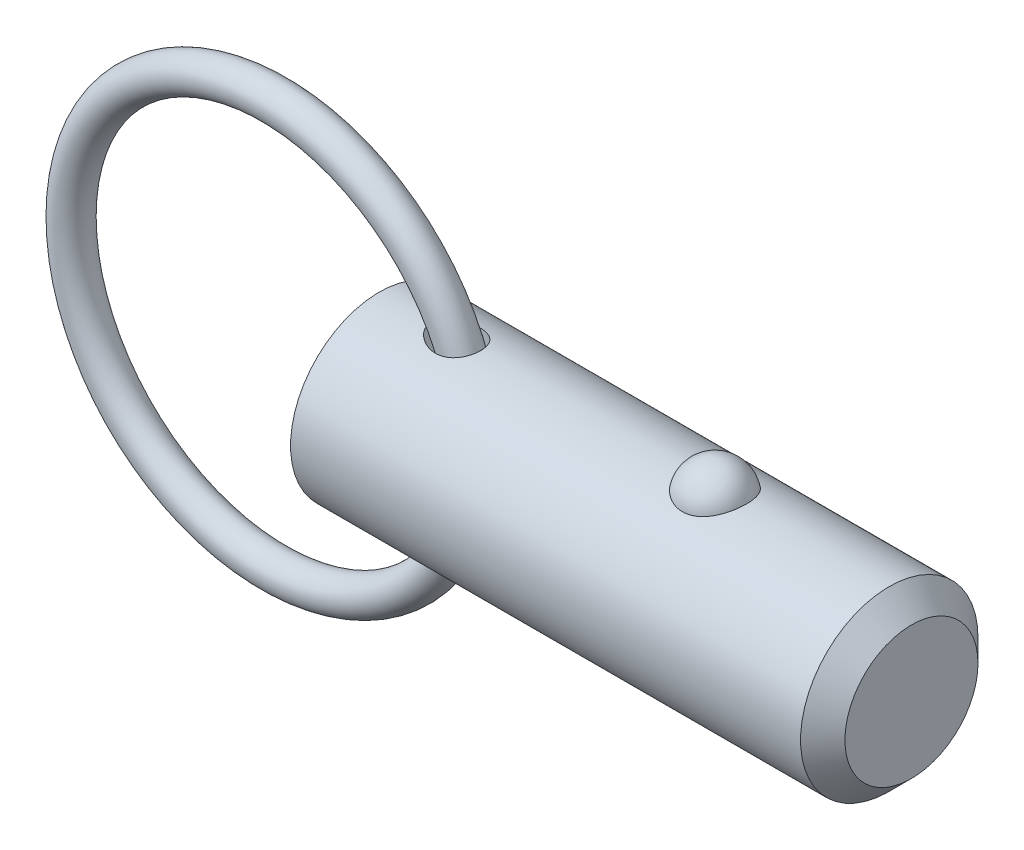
ISO-10303-21;
HEADER;
FILE_DESCRIPTION(('STEP AP214'),'2;1');
FILE_NAME('part.step','',(''),(''),'','','');
FILE_SCHEMA(('AUTOMOTIVE_DESIGN { 1 0 10303 214 1 1 1 1 }'));
ENDSEC;
DATA;
#1=APPLICATION_CONTEXT('core data for automotive mechanical design processes');
#2=APPLICATION_PROTOCOL_DEFINITION('international standard','automotive_design',2000,#1);
#3=PRODUCT_CONTEXT('',#1,'mechanical');
#4=PRODUCT('Part','Part','',(#3));
#5=PRODUCT_RELATED_PRODUCT_CATEGORY('part','',(#4));
#6=PRODUCT_DEFINITION_FORMATION('','',#4);
#7=PRODUCT_DEFINITION_CONTEXT('part definition',#1,'design');
#8=PRODUCT_DEFINITION('design','',#6,#7);
#9=PRODUCT_DEFINITION_SHAPE('','',#8);
#10=(LENGTH_UNIT() NAMED_UNIT(*) SI_UNIT(.MILLI.,.METRE.));
#11=(NAMED_UNIT(*) PLANE_ANGLE_UNIT() SI_UNIT($,.RADIAN.));
#12=(NAMED_UNIT(*) SI_UNIT($,.STERADIAN.) SOLID_ANGLE_UNIT());
#13=UNCERTAINTY_MEASURE_WITH_UNIT(LENGTH_MEASURE(1.E-05),#10,'distance_accuracy_value','');
#14=(GEOMETRIC_REPRESENTATION_CONTEXT(3) GLOBAL_UNCERTAINTY_ASSIGNED_CONTEXT((#13)) GLOBAL_UNIT_ASSIGNED_CONTEXT((#10,
#11,#12)) REPRESENTATION_CONTEXT('',''));
#15=CARTESIAN_POINT('',(0.,0.,0.));
#16=DIRECTION('',(0.,0.,1.));
#17=DIRECTION('',(1.,0.,0.));
#18=AXIS2_PLACEMENT_3D('',#15,#16,#17);
#19=CARTESIAN_POINT('',(-6.5973878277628,0.,0.));
#20=DIRECTION('',(0.,0.,1.));
#21=DIRECTION('',(1.,0.,0.));
#22=AXIS2_PLACEMENT_3D('',#19,#20,#21);
#23=TOROIDAL_SURFACE('',#22,12.7,1.111);
#24=CARTESIAN_POINT('',(7.21361217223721,0.,0.));
#25=VERTEX_POINT('',#24);
#26=VERTEX_LOOP('',#25);
#27=FACE_BOUND('',#26,.T.);
#28=ADVANCED_FACE('P0_F12',(#27),#23,.T.);
#29=CLOSED_SHELL('',(#28));
#30=MANIFOLD_SOLID_BREP('P0_B1',#29);
#31=CARTESIAN_POINT('',(0.,0.,0.));
#32=DIRECTION('',(1.,0.,0.));
#33=DIRECTION('',(0.,0.,-1.));
#34=AXIS2_PLACEMENT_3D('',#31,#32,#33);
#35=CYLINDRICAL_SURFACE('',#34,5.555);
#36=CARTESIAN_POINT('',(3.4079629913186,5.52646850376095,-0.56229074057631));
#37=CARTESIAN_POINT('',(3.45038002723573,5.51879026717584,-0.637753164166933));
#38=CARTESIAN_POINT('',(3.50032814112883,5.50998541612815,-0.70889136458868));
#39=CARTESIAN_POINT('',(3.61174203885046,5.49132550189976,-0.841353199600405));
#40=CARTESIAN_POINT('',(3.67323300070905,5.48146816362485,-0.902654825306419));
#41=CARTESIAN_POINT('',(3.80437942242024,5.46186986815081,-1.01449227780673));
#42=CARTESIAN_POINT('',(3.87396236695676,5.45212862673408,-1.06511378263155));
#43=CARTESIAN_POINT('',(4.01965973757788,5.43359578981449,-1.15594541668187));
#44=CARTESIAN_POINT('',(4.09577226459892,5.42480391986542,-1.19615855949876));
#45=CARTESIAN_POINT('',(4.26620236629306,5.40764958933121,-1.27165209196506));
#46=CARTESIAN_POINT('',(4.36143030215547,5.3996073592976,-1.30496908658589));
#47=CARTESIAN_POINT('',(4.55632904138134,5.38707461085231,-1.35578120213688));
#48=CARTESIAN_POINT('',(4.65600230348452,5.38258608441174,-1.37326745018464));
#49=CARTESIAN_POINT('',(4.85802759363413,5.37803111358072,-1.3910078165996));
#50=CARTESIAN_POINT('',(4.96039620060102,5.37800782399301,-1.39109376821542));
#51=CARTESIAN_POINT('',(5.16321961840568,5.38288845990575,-1.37209481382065));
#52=CARTESIAN_POINT('',(5.2636766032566,5.38778639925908,-1.3530331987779));
#53=CARTESIAN_POINT('',(5.44616808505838,5.40112654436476,-1.29866014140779));
#54=CARTESIAN_POINT('',(5.52893514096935,5.40904875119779,-1.26567968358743));
#55=CARTESIAN_POINT('',(5.68656142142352,5.4273273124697,-1.18484144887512));
#56=CARTESIAN_POINT('',(5.76142575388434,5.43768208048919,-1.13699336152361));
#57=CARTESIAN_POINT('',(5.8928378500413,5.45821422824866,-1.03362464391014));
#58=CARTESIAN_POINT('',(5.95048930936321,5.4682911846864,-0.979480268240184));
#59=CARTESIAN_POINT('',(6.05543937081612,5.48805232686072,-0.861887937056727));
#60=CARTESIAN_POINT('',(6.10274018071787,5.4977365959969,-0.798441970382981));
#61=CARTESIAN_POINT('',(6.18429732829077,5.51527779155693,-0.666351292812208));
#62=CARTESIAN_POINT('',(6.21893047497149,5.52318421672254,-0.597945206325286));
#63=CARTESIAN_POINT('',(6.27643902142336,5.53669785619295,-0.456146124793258));
#64=CARTESIAN_POINT('',(6.299314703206,5.54230512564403,-0.382753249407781));
#65=CARTESIAN_POINT('',(6.33280284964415,5.55061821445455,-0.232999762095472));
#66=CARTESIAN_POINT('',(6.34340498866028,5.55332159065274,-0.156636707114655));
#67=CARTESIAN_POINT('',(6.35208224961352,5.55552923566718,-0.00315477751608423));
#68=CARTESIAN_POINT('',(6.3501570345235,5.55503341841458,0.0739641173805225));
#69=CARTESIAN_POINT('',(6.33379320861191,5.55088854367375,0.22702996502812));
#70=CARTESIAN_POINT('',(6.31931424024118,5.54722931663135,0.302972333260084));
#71=CARTESIAN_POINT('',(6.27810810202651,5.53713917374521,0.451265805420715));
#72=CARTESIAN_POINT('',(6.25138106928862,5.53070828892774,0.523616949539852));
#73=CARTESIAN_POINT('',(6.18634700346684,5.51578851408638,0.662556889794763));
#74=CARTESIAN_POINT('',(6.14805666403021,5.50730259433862,0.729153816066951));
#75=CARTESIAN_POINT('',(6.0608417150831,5.4892059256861,0.854797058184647));
#76=CARTESIAN_POINT('',(6.01191805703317,5.47959527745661,0.91384404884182));
#77=CARTESIAN_POINT('',(5.90496974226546,5.46035411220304,1.0225462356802));
#78=CARTESIAN_POINT('',(5.8469816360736,5.45072382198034,1.07223745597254));
#79=CARTESIAN_POINT('',(5.72342907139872,5.43245016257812,1.16128533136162));
#80=CARTESIAN_POINT('',(5.65786492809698,5.42380675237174,1.20064241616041));
#81=CARTESIAN_POINT('',(5.52033184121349,5.40830592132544,1.26865612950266));
#82=CARTESIAN_POINT('',(5.44830127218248,5.40146883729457,1.2971923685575));
#83=CARTESIAN_POINT('',(5.30051649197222,5.39032432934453,1.34275086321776));
#84=CARTESIAN_POINT('',(5.2247613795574,5.38601752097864,1.35977031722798));
#85=CARTESIAN_POINT('',(5.06697568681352,5.38004503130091,1.3832203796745));
#86=CARTESIAN_POINT('',(4.98483834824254,5.37854992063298,1.38896799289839));
#87=CARTESIAN_POINT('',(4.82062075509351,5.37866467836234,1.38851901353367));
#88=CARTESIAN_POINT('',(4.73854053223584,5.38027567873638,1.38231806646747));
#89=CARTESIAN_POINT('',(4.5665970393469,5.38661928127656,1.35740374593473));
#90=CARTESIAN_POINT('',(4.47694676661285,5.39169506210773,1.33731128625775));
#91=CARTESIAN_POINT('',(4.30168169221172,5.40457769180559,1.28425210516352));
#92=CARTESIAN_POINT('',(4.2160714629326,5.41238755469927,1.25127117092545));
#93=CARTESIAN_POINT('',(4.04117722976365,5.43085841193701,1.16867508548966));
#94=CARTESIAN_POINT('',(3.95261220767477,5.44174460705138,1.11757796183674));
#95=CARTESIAN_POINT('',(3.78568183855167,5.46440376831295,1.00091858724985));
#96=CARTESIAN_POINT('',(3.70730710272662,5.47617590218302,0.935369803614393));
#97=CARTESIAN_POINT('',(3.5829937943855,5.49603821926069,0.809043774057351));
#98=CARTESIAN_POINT('',(3.5339020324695,5.50429522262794,0.751392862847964));
#99=CARTESIAN_POINT('',(3.44556991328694,5.51963490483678,0.628847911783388));
#100=CARTESIAN_POINT('',(3.40631385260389,5.52671944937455,0.563965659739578));
#101=CARTESIAN_POINT('',(3.34553998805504,5.5379053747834,0.439181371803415));
#102=CARTESIAN_POINT('',(3.32216705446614,5.5423057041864,0.380214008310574));
#103=CARTESIAN_POINT('',(3.28543686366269,5.54928356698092,0.259119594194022));
#104=CARTESIAN_POINT('',(3.27207322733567,5.5518622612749,0.196994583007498));
#105=CARTESIAN_POINT('',(3.25633559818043,5.5549036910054,0.0710541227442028));
#106=CARTESIAN_POINT('',(3.25400356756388,5.5553583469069,0.00723314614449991));
#107=CARTESIAN_POINT('',(3.26064251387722,5.55407150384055,-0.119787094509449));
#108=CARTESIAN_POINT('',(3.26961302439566,5.55233009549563,-0.182986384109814));
#109=CARTESIAN_POINT('',(3.29666795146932,5.54714559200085,-0.300518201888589));
#110=CARTESIAN_POINT('',(3.31373453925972,5.54389322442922,-0.355099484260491));
#111=CARTESIAN_POINT('',(3.35543396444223,5.53607951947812,-0.461174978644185));
#112=CARTESIAN_POINT('',(3.38007019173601,5.5315175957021,-0.512667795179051));
#113=CARTESIAN_POINT('',(3.4079629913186,5.52646850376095,-0.56229074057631));
#114=B_SPLINE_CURVE_WITH_KNOTS('',3,(#36,#37,#38,#39,#40,#41,#42,#43,#44,#45,#46,#47,#48,#49,
#50,#51,#52,#53,#54,#55,#56,#57,#58,#59,#60,#61,#62,#63,#64,#65,#66,#67,#68,#69,#70,#71,#72,#73,
#74,#75,#76,#77,#78,#79,#80,#81,#82,#83,#84,#85,#86,#87,#88,#89,#90,#91,#92,#93,#94,#95,#96,#97,
#98,#99,#100,#101,#102,#103,#104,#105,#106,#107,#108,#109,#110,#111,#112,#113),.UNSPECIFIED.,
.T.,.F.,(4,2,2,2,2,2,2,2,2,2,2,2,2,2,2,2,2,2,2,2,2,2,2,2,2,2,2,2,2,2,2,2,2,2,2,2,2,2,4),(0.,
0.260459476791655,0.521493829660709,0.780346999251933,1.03912513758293,1.34137402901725,
1.64379222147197,1.94913302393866,2.25410286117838,2.52092363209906,2.78757087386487,
3.02557563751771,3.26352958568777,3.49368251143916,3.72382991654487,3.9541708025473,
4.18451788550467,4.41560824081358,4.64669600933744,4.87745174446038,5.10818684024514,
5.33801446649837,5.56783253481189,5.80013729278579,6.03249854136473,6.27855081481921,
6.5246927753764,6.79963372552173,7.07487872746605,7.38193573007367,7.68870779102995,
7.91639390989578,8.14371416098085,8.33366541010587,8.52349549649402,8.71404708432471,
8.90459080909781,9.07578823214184,9.24706243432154),.UNSPECIFIED.);
#115=CARTESIAN_POINT('',(3.4079629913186,5.52646850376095,-0.56229074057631));
#116=VERTEX_POINT('',#115);
#117=EDGE_CURVE('P1_E40',#116,#116,#114,.T.);
#118=ORIENTED_EDGE('',*,*,#117,.T.);
#119=EDGE_LOOP('',(#118));
#120=FACE_BOUND('',#119,.T.);
#121=CARTESIAN_POINT('',(31.93125,0.,0.));
#122=DIRECTION('',(1.,0.,0.));
#123=DIRECTION('',(0.,0.,-1.));
#124=AXIS2_PLACEMENT_3D('',#121,#122,#123);
#125=CIRCLE('',#124,5.555);
#126=CARTESIAN_POINT('',(31.93125,0.,-5.555));
#127=VERTEX_POINT('',#126);
#128=EDGE_CURVE('P1_E25',#127,#127,#125,.T.);
#129=ORIENTED_EDGE('',*,*,#128,.F.);
#130=EDGE_LOOP('',(#129));
#131=FACE_BOUND('',#130,.T.);
#132=CARTESIAN_POINT('',(0.,0.,0.));
#133=DIRECTION('',(1.,0.,0.));
#134=DIRECTION('',(0.,0.,-1.));
#135=AXIS2_PLACEMENT_3D('',#132,#133,#134);
#136=CIRCLE('',#135,5.555);
#137=CARTESIAN_POINT('',(0.,0.,-5.555));
#138=VERTEX_POINT('',#137);
#139=EDGE_CURVE('P1_E9',#138,#138,#136,.T.);
#140=ORIENTED_EDGE('',*,*,#139,.T.);
#141=EDGE_LOOP('',(#140));
#142=FACE_BOUND('',#141,.T.);
#143=CARTESIAN_POINT('',(21.0186264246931,5.16741224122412,2.03859650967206));
#144=CARTESIAN_POINT('',(20.9129492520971,5.16740893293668,2.03859990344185));
#145=CARTESIAN_POINT('',(20.8072989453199,5.17079470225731,2.03008306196));
#146=CARTESIAN_POINT('',(20.5991419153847,5.18392795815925,1.99630721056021));
#147=CARTESIAN_POINT('',(20.4966344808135,5.19367399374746,1.97105201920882));
#148=CARTESIAN_POINT('',(20.2977710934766,5.21839168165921,1.90463997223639));
#149=CARTESIAN_POINT('',(20.2014064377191,5.23335573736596,1.86350622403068));
#150=CARTESIAN_POINT('',(20.0170804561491,5.26688076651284,1.76652592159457));
#151=CARTESIAN_POINT('',(19.9291207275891,5.28544242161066,1.71067657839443));
#152=CARTESIAN_POINT('',(19.761265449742,5.32479845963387,1.58399959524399));
#153=CARTESIAN_POINT('',(19.6816656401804,5.34564089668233,1.51279545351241));
#154=CARTESIAN_POINT('',(19.5351290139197,5.38697258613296,1.3582858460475));
#155=CARTESIAN_POINT('',(19.468194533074,5.40746177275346,1.27497815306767));
#156=CARTESIAN_POINT('',(19.3456103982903,5.44694508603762,1.09440293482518));
#157=CARTESIAN_POINT('',(19.2905989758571,5.46583143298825,0.996677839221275));
#158=CARTESIAN_POINT('',(19.1969376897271,5.49908030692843,0.79296193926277));
#159=CARTESIAN_POINT('',(19.1582894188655,5.513442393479,0.686970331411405));
#160=CARTESIAN_POINT('',(19.0976807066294,5.536358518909,0.468019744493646));
#161=CARTESIAN_POINT('',(19.0759725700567,5.54482455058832,0.354981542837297));
#162=CARTESIAN_POINT('',(19.0506362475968,5.55473324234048,0.126595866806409));
#163=CARTESIAN_POINT('',(19.0470077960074,5.55617600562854,0.0112484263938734));
#164=CARTESIAN_POINT('',(19.0578817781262,5.55189984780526,-0.218011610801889));
#165=CARTESIAN_POINT('',(19.0723151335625,5.54620821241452,-0.331928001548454));
#166=CARTESIAN_POINT('',(19.118903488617,5.52828920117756,-0.555544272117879));
#167=CARTESIAN_POINT('',(19.1510588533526,5.5160616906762,-0.665244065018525));
#168=CARTESIAN_POINT('',(19.2324883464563,5.48630779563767,-0.877469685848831));
#169=CARTESIAN_POINT('',(19.2817816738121,5.4687754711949,-0.979987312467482));
#170=CARTESIAN_POINT('',(19.3964785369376,5.43024700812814,-1.17486975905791));
#171=CARTESIAN_POINT('',(19.4618831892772,5.4092506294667,-1.26723387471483));
#172=CARTESIAN_POINT('',(19.6075712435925,5.36600927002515,-1.43940133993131));
#173=CARTESIAN_POINT('',(19.6878859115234,5.34376173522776,-1.51917763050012));
#174=CARTESIAN_POINT('',(19.8614520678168,5.30057971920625,-1.66360338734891));
#175=CARTESIAN_POINT('',(19.954702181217,5.27964509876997,-1.72825445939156));
#176=CARTESIAN_POINT('',(20.1493939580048,5.24205250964,-1.83909478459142));
#177=CARTESIAN_POINT('',(20.2505900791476,5.22530519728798,-1.88568407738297));
#178=CARTESIAN_POINT('',(20.4601552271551,5.19750919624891,-1.96100802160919));
#179=CARTESIAN_POINT('',(20.5685215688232,5.1864583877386,-1.98974931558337));
#180=CARTESIAN_POINT('',(20.7834989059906,5.17184410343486,-2.02742262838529));
#181=CARTESIAN_POINT('',(20.889925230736,5.1679328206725,-2.03727608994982));
#182=CARTESIAN_POINT('',(21.1029925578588,5.16698995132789,-2.03966777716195));
#183=CARTESIAN_POINT('',(21.2096335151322,5.16995704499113,-2.03220932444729));
#184=CARTESIAN_POINT('',(21.4167730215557,5.18222383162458,-2.00071170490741));
#185=CARTESIAN_POINT('',(21.5173599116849,5.19133213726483,-1.97717337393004));
#186=CARTESIAN_POINT('',(21.7130141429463,5.21467637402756,-1.91475248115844));
#187=CARTESIAN_POINT('',(21.8080810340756,5.22891272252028,-1.8758686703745));
#188=CARTESIAN_POINT('',(21.9923711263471,5.26137066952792,-1.7828271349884));
#189=CARTESIAN_POINT('',(22.0814190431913,5.27967329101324,-1.72835124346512));
#190=CARTESIAN_POINT('',(22.2492880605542,5.3181741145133,-1.6059748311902));
#191=CARTESIAN_POINT('',(22.3281068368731,5.33837274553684,-1.53807126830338));
#192=CARTESIAN_POINT('',(22.4775156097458,5.37968287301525,-1.38688970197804));
#193=CARTESIAN_POINT('',(22.5475058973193,5.40079011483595,-1.30301744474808));
#194=CARTESIAN_POINT('',(22.6730125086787,5.44074401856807,-1.12458170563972));
#195=CARTESIAN_POINT('',(22.7285262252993,5.4595902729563,-1.03001630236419));
#196=CARTESIAN_POINT('',(22.8255507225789,5.49369849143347,-0.829439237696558));
#197=CARTESIAN_POINT('',(22.8665483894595,5.50882422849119,-0.723155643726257));
#198=CARTESIAN_POINT('',(22.9311250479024,5.53310911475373,-0.504772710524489));
#199=CARTESIAN_POINT('',(22.9547036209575,5.54226812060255,-0.392673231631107));
#200=CARTESIAN_POINT('',(22.984013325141,5.55370358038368,-0.165459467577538));
#201=CARTESIAN_POINT('',(22.9896884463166,5.55595843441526,-0.0503368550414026));
#202=CARTESIAN_POINT('',(22.982916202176,5.55329317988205,0.179288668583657));
#203=CARTESIAN_POINT('',(22.9704690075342,5.54837313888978,0.293791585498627));
#204=CARTESIAN_POINT('',(22.9277798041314,5.53189037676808,0.518526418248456));
#205=CARTESIAN_POINT('',(22.897598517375,5.5203503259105,0.628771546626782));
#206=CARTESIAN_POINT('',(22.8200962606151,5.49182453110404,0.842318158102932));
#207=CARTESIAN_POINT('',(22.7727743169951,5.47483847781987,0.945619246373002));
#208=CARTESIAN_POINT('',(22.6617204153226,5.43710633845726,1.14281571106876));
#209=CARTESIAN_POINT('',(22.5979215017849,5.41634501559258,1.23667048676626));
#210=CARTESIAN_POINT('',(22.4553577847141,5.37334572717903,1.41185243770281));
#211=CARTESIAN_POINT('',(22.3765932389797,5.35110778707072,1.4931798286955));
#212=CARTESIAN_POINT('',(22.2064234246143,5.30779474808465,1.64049162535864));
#213=CARTESIAN_POINT('',(22.1151002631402,5.28671324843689,1.70656877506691));
#214=CARTESIAN_POINT('',(21.9217390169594,5.24804852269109,1.82201372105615));
#215=CARTESIAN_POINT('',(21.8197005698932,5.23046541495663,1.87138095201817));
#216=CARTESIAN_POINT('',(21.6036187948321,5.20042692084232,1.95335298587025));
#217=CARTESIAN_POINT('',(21.489260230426,5.18820192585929,1.98521734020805));
#218=CARTESIAN_POINT('',(21.2561307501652,5.17169804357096,2.02783294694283));
#219=CARTESIAN_POINT('',(21.1373616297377,5.16741595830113,2.03859269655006));
#220=CARTESIAN_POINT('',(21.0186264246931,5.16741224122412,2.03859650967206));
#221=B_SPLINE_CURVE_WITH_KNOTS('',3,(#143,#144,#145,#146,#147,#148,#149,#150,#151,#152,#153,
#154,#155,#156,#157,#158,#159,#160,#161,#162,#163,#164,#165,#166,#167,#168,#169,#170,#171,#172,
#173,#174,#175,#176,#177,#178,#179,#180,#181,#182,#183,#184,#185,#186,#187,#188,#189,#190,#191,
#192,#193,#194,#195,#196,#197,#198,#199,#200,#201,#202,#203,#204,#205,#206,#207,#208,#209,#210,
#211,#212,#213,#214,#215,#216,#217,#218,#219,#220),.UNSPECIFIED.,.T.,.F.,(4,2,2,2,2,2,2,2,2,2,2,
2,2,2,2,2,2,2,2,2,2,2,2,2,2,2,2,2,2,2,2,2,2,2,2,2,2,2,4),(0.,0.316595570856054,
0.633118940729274,0.949183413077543,1.26530783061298,1.59030762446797,1.9153672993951,
2.25495824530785,2.59458224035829,2.93917283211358,3.28375835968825,3.62703002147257,
3.97030875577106,4.31397329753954,4.65766166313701,5.00207904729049,5.34645984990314,
5.68270547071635,6.01882587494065,6.33808403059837,6.65728093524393,6.96696376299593,
7.27667180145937,7.59321535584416,7.90983070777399,8.24210387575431,8.57443684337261,
8.91755896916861,9.2606893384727,9.60489211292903,9.94909164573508,10.2921194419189,
10.6351667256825,10.9796305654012,11.3240884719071,11.6663928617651,12.0087088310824,
12.3645679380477,12.7202837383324),.UNSPECIFIED.);
#222=CARTESIAN_POINT('',(21.0186264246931,5.16741224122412,2.03859650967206));
#223=VERTEX_POINT('',#222);
#224=EDGE_CURVE('P1_E34',#223,#223,#221,.T.);
#225=ORIENTED_EDGE('',*,*,#224,.T.);
#226=EDGE_LOOP('',(#225));
#227=FACE_BOUND('',#226,.T.);
#228=CARTESIAN_POINT('',(3.4079629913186,-5.52646850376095,-0.56229074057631));
#229=CARTESIAN_POINT('',(3.37716927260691,-5.53204268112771,-0.507507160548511));
#230=CARTESIAN_POINT('',(3.35034276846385,-5.53702335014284,-0.450440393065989));
#231=CARTESIAN_POINT('',(3.30606625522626,-5.54534377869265,-0.3326552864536));
#232=CARTESIAN_POINT('',(3.28860803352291,-5.5486849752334,-0.271940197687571));
#233=CARTESIAN_POINT('',(3.26421203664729,-5.55337514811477,-0.148013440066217));
#234=CARTESIAN_POINT('',(3.25732647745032,-5.55471423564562,-0.0847909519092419));
#235=CARTESIAN_POINT('',(3.25480623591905,-5.5552029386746,0.0418913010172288));
#236=CARTESIAN_POINT('',(3.25917102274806,-5.55435265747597,0.105351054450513));
#237=CARTESIAN_POINT('',(3.27824306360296,-5.55067444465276,0.227039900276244));
#238=CARTESIAN_POINT('',(3.29237198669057,-5.54795714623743,0.285365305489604));
#239=CARTESIAN_POINT('',(3.32941044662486,-5.54094262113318,0.399033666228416));
#240=CARTESIAN_POINT('',(3.3523223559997,-5.53664496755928,0.454375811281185));
#241=CARTESIAN_POINT('',(3.40768868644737,-5.52648234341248,0.56509977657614));
#242=CARTESIAN_POINT('',(3.4407252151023,-5.52052470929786,0.620179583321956));
#243=CARTESIAN_POINT('',(3.51400705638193,-5.50771567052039,0.725188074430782));
#244=CARTESIAN_POINT('',(3.55425830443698,-5.50086353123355,0.775112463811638));
#245=CARTESIAN_POINT('',(3.66122818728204,-5.48337209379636,0.891977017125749));
#246=CARTESIAN_POINT('',(3.73142715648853,-5.47248221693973,0.955709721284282));
#247=CARTESIAN_POINT('',(3.88137100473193,-5.45112279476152,1.07085228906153));
#248=CARTESIAN_POINT('',(3.96113047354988,-5.44065392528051,1.12224294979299));
#249=CARTESIAN_POINT('',(4.12858826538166,-5.42121387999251,1.21269344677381));
#250=CARTESIAN_POINT('',(4.21635930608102,-5.41225908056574,1.25162207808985));
#251=CARTESIAN_POINT('',(4.39702156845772,-5.39704895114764,1.31566440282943));
#252=CARTESIAN_POINT('',(4.48991226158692,-5.39079334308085,1.34077951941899));
#253=CARTESIAN_POINT('',(4.68604255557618,-5.38154547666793,1.37745897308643));
#254=CARTESIAN_POINT('',(4.78952677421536,-5.37884317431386,1.38782444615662));
#255=CARTESIAN_POINT('',(4.9967070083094,-5.3783992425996,1.38955482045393));
#256=CARTESIAN_POINT('',(5.10040282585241,-5.380654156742,1.380932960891));
#257=CARTESIAN_POINT('',(5.29344112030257,-5.3896561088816,1.34533259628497));
#258=CARTESIAN_POINT('',(5.38316618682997,-5.39591960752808,1.32032381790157));
#259=CARTESIAN_POINT('',(5.55593681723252,-5.41176992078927,1.25376768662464));
#260=CARTESIAN_POINT('',(5.63898852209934,-5.42135363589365,1.2122357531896));
#261=CARTESIAN_POINT('',(5.78518175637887,-5.4411584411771,1.1197110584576));
#262=CARTESIAN_POINT('',(5.84951468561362,-5.45115126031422,1.07054233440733));
#263=CARTESIAN_POINT('',(5.96832363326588,-5.47143247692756,0.961516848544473));
#264=CARTESIAN_POINT('',(6.02280238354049,-5.48172079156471,0.901663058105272));
#265=CARTESIAN_POINT('',(6.11773365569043,-5.50082367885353,0.776380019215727));
#266=CARTESIAN_POINT('',(6.15876077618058,-5.50968670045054,0.711392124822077));
#267=CARTESIAN_POINT('',(6.22940016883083,-5.52555592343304,0.575278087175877));
#268=CARTESIAN_POINT('',(6.25901321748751,-5.53256225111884,0.504152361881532));
#269=CARTESIAN_POINT('',(6.30603044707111,-5.54392803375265,0.35809068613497));
#270=CARTESIAN_POINT('',(6.32348246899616,-5.54829785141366,0.283170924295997));
#271=CARTESIAN_POINT('',(6.34598368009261,-5.5539654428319,0.131376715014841));
#272=CARTESIAN_POINT('',(6.35103253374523,-5.55526313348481,0.054502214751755));
#273=CARTESIAN_POINT('',(6.34861245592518,-5.55464639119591,-0.0993401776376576));
#274=CARTESIAN_POINT('',(6.34109421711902,-5.5527193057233,-0.176307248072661));
#275=CARTESIAN_POINT('',(6.31360904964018,-5.54583593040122,-0.327847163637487));
#276=CARTESIAN_POINT('',(6.29364207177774,-5.54087962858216,-0.402419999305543));
#277=CARTESIAN_POINT('',(6.24170966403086,-5.52847553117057,-0.54704108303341));
#278=CARTESIAN_POINT('',(6.20974488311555,-5.52102787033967,-0.617089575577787));
#279=CARTESIAN_POINT('',(6.13458425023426,-5.5044595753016,-0.750655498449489));
#280=CARTESIAN_POINT('',(6.09138916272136,-5.49533905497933,-0.814173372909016));
#281=CARTESIAN_POINT('',(5.99508306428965,-5.47647644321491,-0.932642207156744));
#282=CARTESIAN_POINT('',(5.94201288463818,-5.46673701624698,-0.987626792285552));
#283=CARTESIAN_POINT('',(5.82732079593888,-5.4476756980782,-1.08787197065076));
#284=CARTESIAN_POINT('',(5.76569959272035,-5.43835377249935,-1.133133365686));
#285=CARTESIAN_POINT('',(5.63545565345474,-5.42108746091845,-1.2130627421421));
#286=CARTESIAN_POINT('',(5.56680798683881,-5.41314827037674,-1.24769112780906));
#287=CARTESIAN_POINT('',(5.42470366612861,-5.39946749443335,-1.30562834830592));
#288=CARTESIAN_POINT('',(5.3512462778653,-5.39372624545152,-1.32893545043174));
#289=CARTESIAN_POINT('',(5.19834649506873,-5.38471871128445,-1.36498831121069));
#290=CARTESIAN_POINT('',(5.11878242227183,-5.38156800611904,-1.37724301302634));
#291=CARTESIAN_POINT('',(4.95867408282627,-5.37830368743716,-1.38993264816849));
#292=CARTESIAN_POINT('',(4.87812945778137,-5.37819121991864,-1.39036312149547));
#293=CARTESIAN_POINT('',(4.70952450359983,-5.38096665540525,-1.37958681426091));
#294=CARTESIAN_POINT('',(4.62154757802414,-5.38416579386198,-1.36717293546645));
#295=CARTESIAN_POINT('',(4.44844201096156,-5.39350862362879,-1.32983172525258));
#296=CARTESIAN_POINT('',(4.36331534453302,-5.39965431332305,-1.30489590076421));
#297=CARTESIAN_POINT('',(4.18705584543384,-5.41508127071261,-1.23943340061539));
#298=CARTESIAN_POINT('',(4.09653169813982,-5.42466147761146,-1.19732979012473));
#299=CARTESIAN_POINT('',(3.92355621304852,-5.44542654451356,-1.09903394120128));
#300=CARTESIAN_POINT('',(3.84111059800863,-5.45661252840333,-1.04283181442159));
#301=CARTESIAN_POINT('',(3.69303712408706,-5.47835672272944,-0.921492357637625));
#302=CARTESIAN_POINT('',(3.62661543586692,-5.4888999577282,-0.857326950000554));
#303=CARTESIAN_POINT('',(3.50663841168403,-5.50887375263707,-0.717815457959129));
#304=CARTESIAN_POINT('',(3.45304856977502,-5.51830726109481,-0.642500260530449));
#305=CARTESIAN_POINT('',(3.4079629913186,-5.52646850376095,-0.56229074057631));
#306=B_SPLINE_CURVE_WITH_KNOTS('',3,(#228,#229,#230,#231,#232,#233,#234,#235,#236,#237,#238,
#239,#240,#241,#242,#243,#244,#245,#246,#247,#248,#249,#250,#251,#252,#253,#254,#255,#256,#257,
#258,#259,#260,#261,#262,#263,#264,#265,#266,#267,#268,#269,#270,#271,#272,#273,#274,#275,#276,
#277,#278,#279,#280,#281,#282,#283,#284,#285,#286,#287,#288,#289,#290,#291,#292,#293,#294,#295,
#296,#297,#298,#299,#300,#301,#302,#303,#304,#305),.UNSPECIFIED.,.T.,.F.,(4,2,2,2,2,2,2,2,2,2,2,
2,2,2,2,2,2,2,2,2,2,2,2,2,2,2,2,2,2,2,2,2,2,2,2,2,2,2,4),(0.,0.189054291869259,
0.377942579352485,0.567760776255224,0.757570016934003,0.937004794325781,1.11648807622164,
1.30929480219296,1.50226088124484,1.78704908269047,2.07227755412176,2.3604171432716,
2.64852704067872,2.95892962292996,3.26911584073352,3.5475451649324,3.82571526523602,
4.06921935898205,4.31265584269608,4.54364944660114,4.77462733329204,5.00469135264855,
5.23476159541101,5.46573664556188,5.69671260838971,5.92767607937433,6.15862383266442,
6.38863707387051,6.61863134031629,6.84947196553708,7.08034790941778,7.32103794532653,
7.56181876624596,7.82747997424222,8.09332161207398,8.39289891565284,8.69268692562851,
8.97023931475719,9.24703674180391),.UNSPECIFIED.);
#307=CARTESIAN_POINT('',(3.4079629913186,-5.52646850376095,-0.56229074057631));
#308=VERTEX_POINT('',#307);
#309=EDGE_CURVE('P1_E17',#308,#308,#306,.T.);
#310=ORIENTED_EDGE('',*,*,#309,.T.);
#311=EDGE_LOOP('',(#310));
#312=FACE_BOUND('',#311,.T.);
#313=ADVANCED_FACE('P1_F13',(#120,#131,#142,#227,#312),#35,.T.);
#314=CARTESIAN_POINT('',(0.,0.,0.));
#315=DIRECTION('',(-1.,0.,0.));
#316=DIRECTION('',(0.,0.,1.));
#317=AXIS2_PLACEMENT_3D('',#314,#315,#316);
#318=PLANE('',#317);
#319=ORIENTED_EDGE('',*,*,#139,.F.);
#320=EDGE_LOOP('',(#319));
#321=FACE_BOUND('',#320,.T.);
#322=ADVANCED_FACE('P1_F15',(#321),#318,.T.);
#323=CARTESIAN_POINT('',(33.32,0.,0.));
#324=DIRECTION('',(-1.,0.,0.));
#325=DIRECTION('',(0.,0.,1.));
#326=AXIS2_PLACEMENT_3D('',#323,#324,#325);
#327=CONICAL_SURFACE('',#326,4.16625,0.785398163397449);
#328=ORIENTED_EDGE('',*,*,#128,.T.);
#329=EDGE_LOOP('',(#328));
#330=FACE_BOUND('',#329,.T.);
#331=CARTESIAN_POINT('',(33.32,0.,0.));
#332=DIRECTION('',(1.,0.,0.));
#333=DIRECTION('',(0.,0.,-1.));
#334=AXIS2_PLACEMENT_3D('',#331,#332,#333);
#335=CIRCLE('',#334,4.16625);
#336=CARTESIAN_POINT('',(33.32,0.,-4.16625));
#337=VERTEX_POINT('',#336);
#338=EDGE_CURVE('P1_E30',#337,#337,#335,.T.);
#339=ORIENTED_EDGE('',*,*,#338,.F.);
#340=EDGE_LOOP('',(#339));
#341=FACE_BOUND('',#340,.T.);
#342=ADVANCED_FACE('P1_F55',(#330,#341),#327,.T.);
#343=CARTESIAN_POINT('',(33.32,4.16625,0.));
#344=DIRECTION('',(1.,0.,0.));
#345=DIRECTION('',(0.,0.,-1.));
#346=AXIS2_PLACEMENT_3D('',#343,#344,#345);
#347=PLANE('',#346);
#348=ORIENTED_EDGE('',*,*,#338,.T.);
#349=EDGE_LOOP('',(#348));
#350=FACE_BOUND('',#349,.T.);
#351=ADVANCED_FACE('P1_F51',(#350),#347,.T.);
#352=CARTESIAN_POINT('',(21.0186264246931,4.9995,0.));
#353=DIRECTION('',(-1.,0.,0.));
#354=DIRECTION('',(0.,1.,0.));
#355=AXIS2_PLACEMENT_3D('',#352,#353,#354);
#356=SPHERICAL_SURFACE('',#355,2.04550000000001);
#357=ORIENTED_EDGE('',*,*,#224,.F.);
#358=EDGE_LOOP('',(#357));
#359=FACE_BOUND('',#358,.T.);
#360=ADVANCED_FACE('P1_F46',(#359),#356,.T.);
#361=CARTESIAN_POINT('',(-6.5973878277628,0.,0.));
#362=DIRECTION('',(0.,0.,1.));
#363=DIRECTION('',(1.,0.,0.));
#364=AXIS2_PLACEMENT_3D('',#361,#362,#363);
#365=TOROIDAL_SURFACE('',#364,12.7,1.38875);
#366=ORIENTED_EDGE('',*,*,#309,.F.);
#367=EDGE_LOOP('',(#366));
#368=FACE_BOUND('',#367,.T.);
#369=ORIENTED_EDGE('',*,*,#117,.F.);
#370=EDGE_LOOP('',(#369));
#371=FACE_BOUND('',#370,.T.);
#372=ADVANCED_FACE('P1_F50',(#368,#371),#365,.F.);
#373=CLOSED_SHELL('',(#313,#322,#342,#351,#360,#372));
#374=MANIFOLD_SOLID_BREP('P1_B1',#373);
#375=ADVANCED_BREP_SHAPE_REPRESENTATION('',(#18,#30,#374),#14);
#376=SHAPE_DEFINITION_REPRESENTATION(#9,#375);
ENDSEC;
END-ISO-10303-21;
